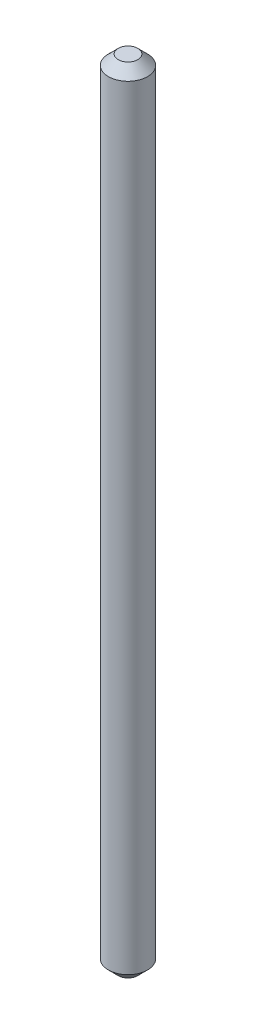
from build123d import *

# Parameters (mm, degrees)
SKETCH1_R      = 2
EXTRUDE1_DEPTH = 81
CHAMFER1_SIZE  = 1


with BuildPart() as part:
    # Sketch1 → Extrude1 (new body)
    with BuildSketch(Plane(origin=(0, 0, 0), x_dir=(1, 0, 0), z_dir=(0, 1, 0))):
        with Locations(Location((0, 0, 0), (0, 0, 270))):
            Circle(SKETCH1_R)
    extrude(amount=EXTRUDE1_DEPTH)

    # Chamfer1
    chamfer1_edges = [part.edges().sort_by_distance(p)[0] for p in [
        (0, 0, -2),
        (0, 81, -2),
    ]]
    chamfer(chamfer1_edges, length=CHAMFER1_SIZE)


solid = part.part
